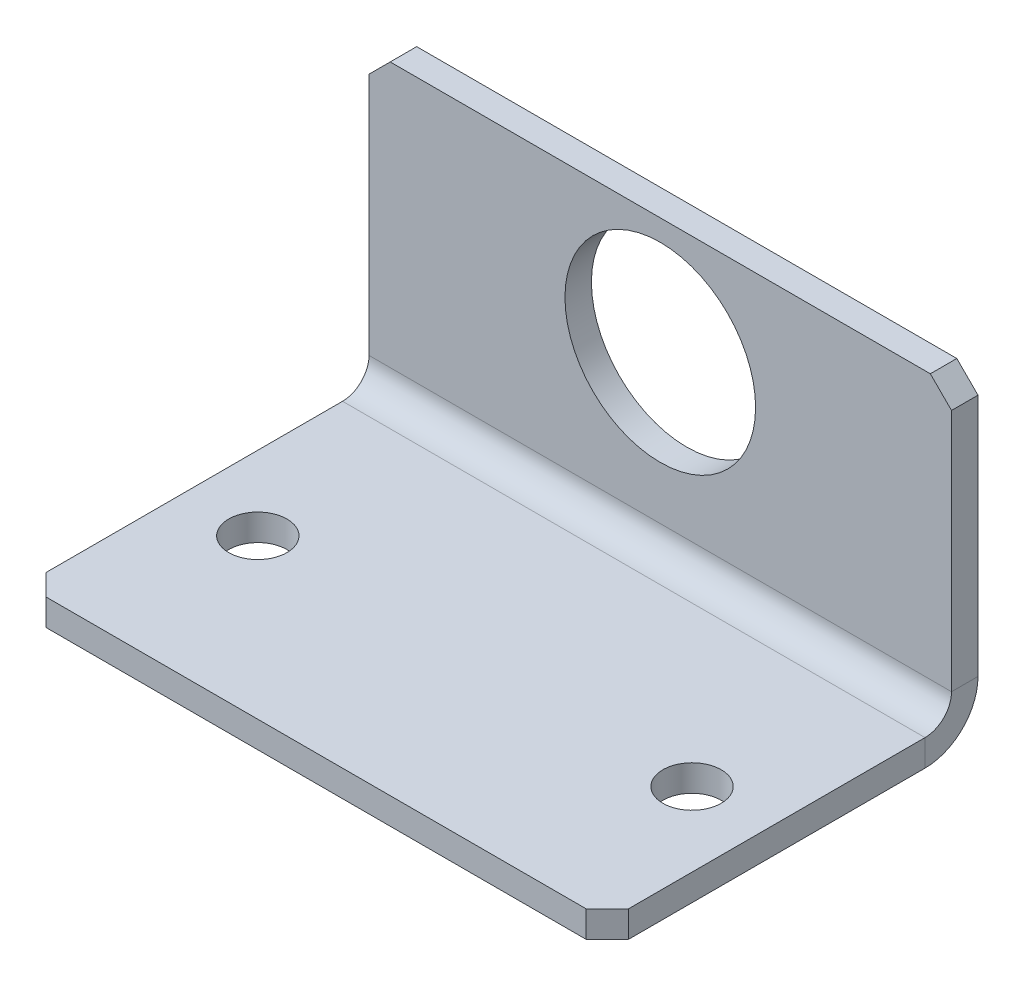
ISO-10303-21;
HEADER;
FILE_DESCRIPTION(('STEP AP214'),'2;1');
FILE_NAME('part.step','',(''),(''),'','','');
FILE_SCHEMA(('AUTOMOTIVE_DESIGN { 1 0 10303 214 1 1 1 1 }'));
ENDSEC;
DATA;
#1=APPLICATION_CONTEXT('core data for automotive mechanical design processes');
#2=APPLICATION_PROTOCOL_DEFINITION('international standard','automotive_design',2000,#1);
#3=PRODUCT_CONTEXT('',#1,'mechanical');
#4=PRODUCT('Part','Part','',(#3));
#5=PRODUCT_RELATED_PRODUCT_CATEGORY('part','',(#4));
#6=PRODUCT_DEFINITION_FORMATION('','',#4);
#7=PRODUCT_DEFINITION_CONTEXT('part definition',#1,'design');
#8=PRODUCT_DEFINITION('design','',#6,#7);
#9=PRODUCT_DEFINITION_SHAPE('','',#8);
#10=(LENGTH_UNIT() NAMED_UNIT(*) SI_UNIT(.MILLI.,.METRE.));
#11=(NAMED_UNIT(*) PLANE_ANGLE_UNIT() SI_UNIT($,.RADIAN.));
#12=(NAMED_UNIT(*) SI_UNIT($,.STERADIAN.) SOLID_ANGLE_UNIT());
#13=UNCERTAINTY_MEASURE_WITH_UNIT(LENGTH_MEASURE(1.E-05),#10,'distance_accuracy_value','');
#14=(GEOMETRIC_REPRESENTATION_CONTEXT(3) GLOBAL_UNCERTAINTY_ASSIGNED_CONTEXT((#13)) GLOBAL_UNIT_ASSIGNED_CONTEXT((#10,
#11,#12)) REPRESENTATION_CONTEXT('',''));
#15=CARTESIAN_POINT('',(0.,0.,0.));
#16=DIRECTION('',(0.,0.,1.));
#17=DIRECTION('',(1.,0.,0.));
#18=AXIS2_PLACEMENT_3D('',#15,#16,#17);
#19=CARTESIAN_POINT('',(27.4999999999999,0.,5.00000000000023));
#20=DIRECTION('',(1.,0.,0.));
#21=DIRECTION('',(0.,0.,-1.));
#22=AXIS2_PLACEMENT_3D('',#19,#20,#21);
#23=PLANE('',#22);
#24=DIRECTION('',(0.,1.,0.));
#25=VECTOR('',#24,1.);
#26=CARTESIAN_POINT('',(27.4999999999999,0.,5.00000000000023));
#27=LINE('',#26,#25);
#28=CARTESIAN_POINT('',(27.4999999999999,0.,5.00000000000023));
#29=VERTEX_POINT('',#28);
#30=CARTESIAN_POINT('',(27.5000000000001,2.5,5.00000000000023));
#31=VERTEX_POINT('',#30);
#32=EDGE_CURVE('E143',#29,#31,#27,.T.);
#33=ORIENTED_EDGE('',*,*,#32,.F.);
#34=CARTESIAN_POINT('',(27.5000000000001,5.,5.00000000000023));
#35=DIRECTION('',(-1.,0.,0.));
#36=DIRECTION('',(0.,0.,1.));
#37=AXIS2_PLACEMENT_3D('',#34,#35,#36);
#38=CIRCLE('',#37,5.);
#39=CARTESIAN_POINT('',(27.4999999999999,5.,2.35922392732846E-13));
#40=VERTEX_POINT('',#39);
#41=EDGE_CURVE('E140',#29,#40,#38,.F.);
#42=ORIENTED_EDGE('',*,*,#41,.T.);
#43=DIRECTION('',(0.,0.,-1.));
#44=VECTOR('',#43,1.);
#45=CARTESIAN_POINT('',(27.5000000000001,5.,2.50000000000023));
#46=LINE('',#45,#44);
#47=CARTESIAN_POINT('',(27.5000000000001,5.,2.50000000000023));
#48=VERTEX_POINT('',#47);
#49=EDGE_CURVE('E134',#48,#40,#46,.T.);
#50=ORIENTED_EDGE('',*,*,#49,.F.);
#51=CARTESIAN_POINT('',(27.5000000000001,5.,5.00000000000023));
#52=DIRECTION('',(1.,0.,0.));
#53=DIRECTION('',(0.,0.,-1.));
#54=AXIS2_PLACEMENT_3D('',#51,#52,#53);
#55=CIRCLE('',#54,2.5);
#56=EDGE_CURVE('E138',#31,#48,#55,.T.);
#57=ORIENTED_EDGE('',*,*,#56,.F.);
#58=EDGE_LOOP('',(#33,#42,#50,#57));
#59=FACE_BOUND('',#58,.T.);
#60=ADVANCED_FACE('F40',(#59),#23,.T.);
#61=CARTESIAN_POINT('',(27.5000000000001,5.,2.50000000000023));
#62=DIRECTION('',(1.,0.,0.));
#63=DIRECTION('',(0.,0.,-1.));
#64=AXIS2_PLACEMENT_3D('',#61,#62,#63);
#65=PLANE('',#64);
#66=DIRECTION('',(0.,0.,-1.));
#67=VECTOR('',#66,1.);
#68=CARTESIAN_POINT('',(27.5000000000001,2.5,35.));
#69=LINE('',#68,#67);
#70=CARTESIAN_POINT('',(27.5000000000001,2.5,33.));
#71=VERTEX_POINT('',#70);
#72=EDGE_CURVE('E167',#71,#31,#69,.T.);
#73=ORIENTED_EDGE('',*,*,#72,.F.);
#74=DIRECTION('',(0.,-1.,0.));
#75=VECTOR('',#74,1.);
#76=CARTESIAN_POINT('',(27.5000000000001,5.,33.));
#77=LINE('',#76,#75);
#78=CARTESIAN_POINT('',(27.5000000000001,0.,33.));
#79=VERTEX_POINT('',#78);
#80=EDGE_CURVE('E254',#71,#79,#77,.T.);
#81=ORIENTED_EDGE('',*,*,#80,.T.);
#82=DIRECTION('',(0.,0.,-1.));
#83=VECTOR('',#82,1.);
#84=CARTESIAN_POINT('',(27.5000000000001,0.,35.));
#85=LINE('',#84,#83);
#86=EDGE_CURVE('E172',#79,#29,#85,.T.);
#87=ORIENTED_EDGE('',*,*,#86,.T.);
#88=ORIENTED_EDGE('',*,*,#32,.T.);
#89=EDGE_LOOP('',(#73,#81,#87,#88));
#90=FACE_BOUND('',#89,.T.);
#91=ADVANCED_FACE('F324',(#90),#65,.T.);
#92=CARTESIAN_POINT('',(-27.4999999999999,5.,0.));
#93=DIRECTION('',(-1.,0.,0.));
#94=DIRECTION('',(0.,0.,1.));
#95=AXIS2_PLACEMENT_3D('',#92,#93,#94);
#96=PLANE('',#95);
#97=DIRECTION('',(0.,0.,1.));
#98=VECTOR('',#97,1.);
#99=CARTESIAN_POINT('',(-27.4999999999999,5.,0.));
#100=LINE('',#99,#98);
#101=CARTESIAN_POINT('',(-27.4999999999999,5.,0.));
#102=VERTEX_POINT('',#101);
#103=CARTESIAN_POINT('',(-27.4999999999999,5.,2.5));
#104=VERTEX_POINT('',#103);
#105=EDGE_CURVE('E144',#102,#104,#100,.T.);
#106=ORIENTED_EDGE('',*,*,#105,.F.);
#107=CARTESIAN_POINT('',(-27.4999999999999,5.,5.));
#108=DIRECTION('',(-1.,0.,0.));
#109=DIRECTION('',(0.,0.,1.));
#110=AXIS2_PLACEMENT_3D('',#107,#108,#109);
#111=CIRCLE('',#110,5.);
#112=CARTESIAN_POINT('',(-27.4999999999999,0.,5.));
#113=VERTEX_POINT('',#112);
#114=EDGE_CURVE('E197',#113,#102,#111,.F.);
#115=ORIENTED_EDGE('',*,*,#114,.F.);
#116=DIRECTION('',(0.,-1.,0.));
#117=VECTOR('',#116,1.);
#118=CARTESIAN_POINT('',(-27.4999999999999,2.5,5.));
#119=LINE('',#118,#117);
#120=CARTESIAN_POINT('',(-27.4999999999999,2.5,5.));
#121=VERTEX_POINT('',#120);
#122=EDGE_CURVE('E223',#121,#113,#119,.T.);
#123=ORIENTED_EDGE('',*,*,#122,.F.);
#124=CARTESIAN_POINT('',(-27.4999999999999,5.,5.));
#125=DIRECTION('',(1.,0.,0.));
#126=DIRECTION('',(0.,0.,-1.));
#127=AXIS2_PLACEMENT_3D('',#124,#125,#126);
#128=CIRCLE('',#127,2.5);
#129=EDGE_CURVE('E188',#121,#104,#128,.T.);
#130=ORIENTED_EDGE('',*,*,#129,.T.);
#131=EDGE_LOOP('',(#106,#115,#123,#130));
#132=FACE_BOUND('',#131,.T.);
#133=ADVANCED_FACE('F329',(#132),#96,.T.);
#134=CARTESIAN_POINT('',(-27.4999999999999,2.5,5.));
#135=DIRECTION('',(-1.,0.,0.));
#136=DIRECTION('',(0.,0.,1.));
#137=AXIS2_PLACEMENT_3D('',#134,#135,#136);
#138=PLANE('',#137);
#139=DIRECTION('',(0.,1.,0.));
#140=VECTOR('',#139,1.);
#141=CARTESIAN_POINT('',(-27.4999999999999,0.,2.5));
#142=LINE('',#141,#140);
#143=CARTESIAN_POINT('',(-27.4999999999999,28.,2.5));
#144=VERTEX_POINT('',#143);
#145=EDGE_CURVE('E151',#104,#144,#142,.T.);
#146=ORIENTED_EDGE('',*,*,#145,.T.);
#147=DIRECTION('',(0.,0.,-1.));
#148=VECTOR('',#147,1.);
#149=CARTESIAN_POINT('',(-27.4999999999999,28.,5.));
#150=LINE('',#149,#148);
#151=CARTESIAN_POINT('',(-27.4999999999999,28.,0.));
#152=VERTEX_POINT('',#151);
#153=EDGE_CURVE('E11',#144,#152,#150,.T.);
#154=ORIENTED_EDGE('',*,*,#153,.T.);
#155=DIRECTION('',(0.,1.,0.));
#156=VECTOR('',#155,1.);
#157=CARTESIAN_POINT('',(-27.4999999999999,0.,0.));
#158=LINE('',#157,#156);
#159=EDGE_CURVE('E181',#102,#152,#158,.T.);
#160=ORIENTED_EDGE('',*,*,#159,.F.);
#161=ORIENTED_EDGE('',*,*,#105,.T.);
#162=EDGE_LOOP('',(#146,#154,#160,#161));
#163=FACE_BOUND('',#162,.T.);
#164=ADVANCED_FACE('F351',(#163),#138,.T.);
#165=CARTESIAN_POINT('',(27.4999999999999,0.,2.35922392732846E-13));
#166=DIRECTION('',(0.,0.,1.));
#167=DIRECTION('',(1.,0.,0.));
#168=AXIS2_PLACEMENT_3D('',#165,#166,#167);
#169=PLANE('',#168);
#170=CARTESIAN_POINT('',(0.,19.,0.));
#171=DIRECTION('',(0.,0.,1.));
#172=DIRECTION('',(1.,0.,0.));
#173=AXIS2_PLACEMENT_3D('',#170,#171,#172);
#174=CIRCLE('',#173,9.);
#175=CARTESIAN_POINT('',(9.,19.,0.));
#176=VERTEX_POINT('',#175);
#177=EDGE_CURVE('E303',#176,#176,#174,.F.);
#178=ORIENTED_EDGE('',*,*,#177,.F.);
#179=EDGE_LOOP('',(#178));
#180=FACE_BOUND('',#179,.T.);
#181=DIRECTION('',(-1.,0.,0.));
#182=VECTOR('',#181,1.);
#183=CARTESIAN_POINT('',(27.5000000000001,30.,2.35922392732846E-13));
#184=LINE('',#183,#182);
#185=CARTESIAN_POINT('',(25.5000000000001,30.,2.35922392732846E-13));
#186=VERTEX_POINT('',#185);
#187=CARTESIAN_POINT('',(-25.4999999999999,30.,0.));
#188=VERTEX_POINT('',#187);
#189=EDGE_CURVE('E220',#186,#188,#184,.T.);
#190=ORIENTED_EDGE('',*,*,#189,.F.);
#191=DIRECTION('',(-0.707106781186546,0.707106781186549,0.));
#192=VECTOR('',#191,1.);
#193=CARTESIAN_POINT('',(25.5000000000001,30.,2.35922392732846E-13));
#194=LINE('',#193,#192);
#195=CARTESIAN_POINT('',(27.5000000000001,28.,2.35922392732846E-13));
#196=VERTEX_POINT('',#195);
#197=EDGE_CURVE('E267',#186,#196,#194,.F.);
#198=ORIENTED_EDGE('',*,*,#197,.T.);
#199=DIRECTION('',(0.,1.,0.));
#200=VECTOR('',#199,1.);
#201=CARTESIAN_POINT('',(27.4999999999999,0.,2.35922392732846E-13));
#202=LINE('',#201,#200);
#203=EDGE_CURVE('E161',#40,#196,#202,.T.);
#204=ORIENTED_EDGE('',*,*,#203,.F.);
#205=DIRECTION('',(-1.,0.,0.));
#206=VECTOR('',#205,1.);
#207=CARTESIAN_POINT('',(27.4999999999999,5.,2.35922392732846E-13));
#208=LINE('',#207,#206);
#209=EDGE_CURVE('E180',#40,#102,#208,.T.);
#210=ORIENTED_EDGE('',*,*,#209,.T.);
#211=ORIENTED_EDGE('',*,*,#159,.T.);
#212=DIRECTION('',(-0.707106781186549,-0.707106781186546,0.));
#213=VECTOR('',#212,1.);
#214=CARTESIAN_POINT('',(-27.4999999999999,28.,0.));
#215=LINE('',#214,#213);
#216=EDGE_CURVE('E264',#152,#188,#215,.F.);
#217=ORIENTED_EDGE('',*,*,#216,.T.);
#218=EDGE_LOOP('',(#190,#198,#204,#210,#211,#217));
#219=FACE_BOUND('',#218,.T.);
#220=ADVANCED_FACE('F285',(#180,#219),#169,.F.);
#221=CARTESIAN_POINT('',(27.5000000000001,30.,2.50000000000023));
#222=DIRECTION('',(0.,1.,0.));
#223=DIRECTION('',(0.,0.,1.));
#224=AXIS2_PLACEMENT_3D('',#221,#222,#223);
#225=PLANE('',#224);
#226=DIRECTION('',(-1.,0.,0.));
#227=VECTOR('',#226,1.);
#228=CARTESIAN_POINT('',(27.5000000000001,30.,2.50000000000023));
#229=LINE('',#228,#227);
#230=CARTESIAN_POINT('',(25.5000000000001,30.,2.50000000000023));
#231=VERTEX_POINT('',#230);
#232=CARTESIAN_POINT('',(-25.4999999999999,30.,2.5));
#233=VERTEX_POINT('',#232);
#234=EDGE_CURVE('E156',#231,#233,#229,.T.);
#235=ORIENTED_EDGE('',*,*,#234,.F.);
#236=DIRECTION('',(0.,0.,-1.));
#237=VECTOR('',#236,1.);
#238=CARTESIAN_POINT('',(25.5000000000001,30.,2.50000000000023));
#239=LINE('',#238,#237);
#240=EDGE_CURVE('E260',#231,#186,#239,.T.);
#241=ORIENTED_EDGE('',*,*,#240,.T.);
#242=ORIENTED_EDGE('',*,*,#189,.T.);
#243=DIRECTION('',(0.,0.,1.));
#244=VECTOR('',#243,1.);
#245=CARTESIAN_POINT('',(-25.4999999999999,30.,2.5));
#246=LINE('',#245,#244);
#247=EDGE_CURVE('E257',#188,#233,#246,.T.);
#248=ORIENTED_EDGE('',*,*,#247,.T.);
#249=EDGE_LOOP('',(#235,#241,#242,#248));
#250=FACE_BOUND('',#249,.T.);
#251=ADVANCED_FACE('F279',(#250),#225,.T.);
#252=CARTESIAN_POINT('',(27.4999999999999,0.,2.50000000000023));
#253=DIRECTION('',(0.,0.,1.));
#254=DIRECTION('',(1.,0.,0.));
#255=AXIS2_PLACEMENT_3D('',#252,#253,#254);
#256=PLANE('',#255);
#257=CARTESIAN_POINT('',(0.,19.,2.5));
#258=DIRECTION('',(0.,0.,1.));
#259=DIRECTION('',(1.,0.,0.));
#260=AXIS2_PLACEMENT_3D('',#257,#258,#259);
#261=CIRCLE('',#260,9.);
#262=CARTESIAN_POINT('',(9.,19.,2.5));
#263=VERTEX_POINT('',#262);
#264=EDGE_CURVE('E306',#263,#263,#261,.T.);
#265=ORIENTED_EDGE('',*,*,#264,.F.);
#266=EDGE_LOOP('',(#265));
#267=FACE_BOUND('',#266,.T.);
#268=DIRECTION('',(0.,1.,0.));
#269=VECTOR('',#268,1.);
#270=CARTESIAN_POINT('',(27.4999999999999,0.,2.50000000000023));
#271=LINE('',#270,#269);
#272=CARTESIAN_POINT('',(27.5000000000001,28.,2.50000000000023));
#273=VERTEX_POINT('',#272);
#274=EDGE_CURVE('E149',#48,#273,#271,.T.);
#275=ORIENTED_EDGE('',*,*,#274,.T.);
#276=DIRECTION('',(0.707106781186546,-0.707106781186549,0.));
#277=VECTOR('',#276,1.);
#278=CARTESIAN_POINT('',(41.5000000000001,14.,2.50000000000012));
#279=LINE('',#278,#277);
#280=EDGE_CURVE('E49',#273,#231,#279,.F.);
#281=ORIENTED_EDGE('',*,*,#280,.T.);
#282=ORIENTED_EDGE('',*,*,#234,.T.);
#283=DIRECTION('',(0.707106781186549,0.707106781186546,0.));
#284=VECTOR('',#283,1.);
#285=CARTESIAN_POINT('',(-13.9999999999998,41.5,2.50000000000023));
#286=LINE('',#285,#284);
#287=EDGE_CURVE('E56',#233,#144,#286,.F.);
#288=ORIENTED_EDGE('',*,*,#287,.T.);
#289=ORIENTED_EDGE('',*,*,#145,.F.);
#290=DIRECTION('',(-1.,0.,0.));
#291=VECTOR('',#290,1.);
#292=CARTESIAN_POINT('',(27.5000000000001,5.,2.50000000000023));
#293=LINE('',#292,#291);
#294=EDGE_CURVE('E147',#48,#104,#293,.T.);
#295=ORIENTED_EDGE('',*,*,#294,.F.);
#296=EDGE_LOOP('',(#275,#281,#282,#288,#289,#295));
#297=FACE_BOUND('',#296,.T.);
#298=ADVANCED_FACE('F148',(#267,#297),#256,.T.);
#299=CARTESIAN_POINT('',(27.5000000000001,5.,5.00000000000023));
#300=DIRECTION('',(-1.,0.,0.));
#301=DIRECTION('',(0.,0.,1.));
#302=AXIS2_PLACEMENT_3D('',#299,#300,#301);
#303=CYLINDRICAL_SURFACE('',#302,2.5);
#304=ORIENTED_EDGE('',*,*,#129,.F.);
#305=DIRECTION('',(-1.,0.,0.));
#306=VECTOR('',#305,1.);
#307=CARTESIAN_POINT('',(27.5000000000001,2.5,5.00000000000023));
#308=LINE('',#307,#306);
#309=EDGE_CURVE('E157',#31,#121,#308,.T.);
#310=ORIENTED_EDGE('',*,*,#309,.F.);
#311=ORIENTED_EDGE('',*,*,#56,.T.);
#312=ORIENTED_EDGE('',*,*,#294,.T.);
#313=EDGE_LOOP('',(#304,#310,#311,#312));
#314=FACE_BOUND('',#313,.T.);
#315=ADVANCED_FACE('F164',(#314),#303,.F.);
#316=CARTESIAN_POINT('',(27.5000000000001,2.5,35.));
#317=DIRECTION('',(0.,1.,0.));
#318=DIRECTION('',(0.,0.,1.));
#319=AXIS2_PLACEMENT_3D('',#316,#317,#318);
#320=PLANE('',#319);
#321=CARTESIAN_POINT('',(-20.5,2.5,20.));
#322=DIRECTION('',(0.,1.,0.));
#323=DIRECTION('',(0.,0.,1.));
#324=AXIS2_PLACEMENT_3D('',#321,#322,#323);
#325=CIRCLE('',#324,2.75);
#326=CARTESIAN_POINT('',(-20.5,2.5,22.75));
#327=VERTEX_POINT('',#326);
#328=EDGE_CURVE('E299',#327,#327,#325,.T.);
#329=ORIENTED_EDGE('',*,*,#328,.F.);
#330=EDGE_LOOP('',(#329));
#331=FACE_BOUND('',#330,.T.);
#332=CARTESIAN_POINT('',(20.5,2.5,20.));
#333=DIRECTION('',(0.,1.,0.));
#334=DIRECTION('',(0.,0.,1.));
#335=AXIS2_PLACEMENT_3D('',#332,#333,#334);
#336=CIRCLE('',#335,2.75);
#337=CARTESIAN_POINT('',(20.5,2.5,22.75));
#338=VERTEX_POINT('',#337);
#339=EDGE_CURVE('E292',#338,#338,#336,.T.);
#340=ORIENTED_EDGE('',*,*,#339,.F.);
#341=EDGE_LOOP('',(#340));
#342=FACE_BOUND('',#341,.T.);
#343=DIRECTION('',(0.,0.,-1.));
#344=VECTOR('',#343,1.);
#345=CARTESIAN_POINT('',(-27.4999999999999,2.5,35.));
#346=LINE('',#345,#344);
#347=CARTESIAN_POINT('',(-27.4999999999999,2.5,33.));
#348=VERTEX_POINT('',#347);
#349=EDGE_CURVE('E191',#348,#121,#346,.T.);
#350=ORIENTED_EDGE('',*,*,#349,.F.);
#351=DIRECTION('',(0.707106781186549,0.,0.707106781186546));
#352=VECTOR('',#351,1.);
#353=CARTESIAN_POINT('',(1.00000000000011,2.5,61.5));
#354=LINE('',#353,#352);
#355=CARTESIAN_POINT('',(-25.4999999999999,2.5,35.));
#356=VERTEX_POINT('',#355);
#357=EDGE_CURVE('E238',#348,#356,#354,.T.);
#358=ORIENTED_EDGE('',*,*,#357,.T.);
#359=DIRECTION('',(-1.,0.,0.));
#360=VECTOR('',#359,1.);
#361=CARTESIAN_POINT('',(27.5000000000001,2.5,35.));
#362=LINE('',#361,#360);
#363=CARTESIAN_POINT('',(25.5000000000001,2.5,35.));
#364=VERTEX_POINT('',#363);
#365=EDGE_CURVE('E212',#364,#356,#362,.T.);
#366=ORIENTED_EDGE('',*,*,#365,.F.);
#367=DIRECTION('',(-0.707106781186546,0.,0.707106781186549));
#368=VECTOR('',#367,1.);
#369=CARTESIAN_POINT('',(26.5,2.5,34.));
#370=LINE('',#369,#368);
#371=EDGE_CURVE('E235',#364,#71,#370,.F.);
#372=ORIENTED_EDGE('',*,*,#371,.T.);
#373=ORIENTED_EDGE('',*,*,#72,.T.);
#374=ORIENTED_EDGE('',*,*,#309,.T.);
#375=EDGE_LOOP('',(#350,#358,#366,#372,#373,#374));
#376=FACE_BOUND('',#375,.T.);
#377=ADVANCED_FACE('F320',(#331,#342,#376),#320,.T.);
#378=CARTESIAN_POINT('',(27.5000000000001,0.,35.));
#379=DIRECTION('',(0.,0.,1.));
#380=DIRECTION('',(1.,0.,0.));
#381=AXIS2_PLACEMENT_3D('',#378,#379,#380);
#382=PLANE('',#381);
#383=ORIENTED_EDGE('',*,*,#365,.T.);
#384=DIRECTION('',(0.,-1.,0.));
#385=VECTOR('',#384,1.);
#386=CARTESIAN_POINT('',(-25.4999999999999,0.,35.));
#387=LINE('',#386,#385);
#388=CARTESIAN_POINT('',(-25.4999999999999,0.,35.));
#389=VERTEX_POINT('',#388);
#390=EDGE_CURVE('E245',#356,#389,#387,.T.);
#391=ORIENTED_EDGE('',*,*,#390,.T.);
#392=DIRECTION('',(-1.,0.,0.));
#393=VECTOR('',#392,1.);
#394=CARTESIAN_POINT('',(27.5000000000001,0.,35.));
#395=LINE('',#394,#393);
#396=CARTESIAN_POINT('',(25.5000000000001,0.,35.));
#397=VERTEX_POINT('',#396);
#398=EDGE_CURVE('E208',#397,#389,#395,.T.);
#399=ORIENTED_EDGE('',*,*,#398,.F.);
#400=DIRECTION('',(0.,1.,0.));
#401=VECTOR('',#400,1.);
#402=CARTESIAN_POINT('',(25.5000000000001,0.,35.));
#403=LINE('',#402,#401);
#404=EDGE_CURVE('E241',#397,#364,#403,.T.);
#405=ORIENTED_EDGE('',*,*,#404,.T.);
#406=EDGE_LOOP('',(#383,#391,#399,#405));
#407=FACE_BOUND('',#406,.T.);
#408=ADVANCED_FACE('F374',(#407),#382,.T.);
#409=CARTESIAN_POINT('',(27.5000000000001,0.,35.));
#410=DIRECTION('',(0.,1.,0.));
#411=DIRECTION('',(0.,0.,1.));
#412=AXIS2_PLACEMENT_3D('',#409,#410,#411);
#413=PLANE('',#412);
#414=CARTESIAN_POINT('',(-20.5,0.,20.));
#415=DIRECTION('',(0.,1.,0.));
#416=DIRECTION('',(0.,0.,1.));
#417=AXIS2_PLACEMENT_3D('',#414,#415,#416);
#418=CIRCLE('',#417,2.75);
#419=CARTESIAN_POINT('',(-20.5,0.,22.75));
#420=VERTEX_POINT('',#419);
#421=EDGE_CURVE('E295',#420,#420,#418,.F.);
#422=ORIENTED_EDGE('',*,*,#421,.F.);
#423=EDGE_LOOP('',(#422));
#424=FACE_BOUND('',#423,.T.);
#425=CARTESIAN_POINT('',(20.5,0.,20.));
#426=DIRECTION('',(0.,1.,0.));
#427=DIRECTION('',(0.,0.,1.));
#428=AXIS2_PLACEMENT_3D('',#425,#426,#427);
#429=CIRCLE('',#428,2.75);
#430=CARTESIAN_POINT('',(20.5,0.,22.75));
#431=VERTEX_POINT('',#430);
#432=EDGE_CURVE('E185',#431,#431,#429,.F.);
#433=ORIENTED_EDGE('',*,*,#432,.F.);
#434=EDGE_LOOP('',(#433));
#435=FACE_BOUND('',#434,.T.);
#436=ORIENTED_EDGE('',*,*,#398,.T.);
#437=DIRECTION('',(-0.707106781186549,0.,-0.707106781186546));
#438=VECTOR('',#437,1.);
#439=CARTESIAN_POINT('',(-27.4999999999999,0.,33.));
#440=LINE('',#439,#438);
#441=CARTESIAN_POINT('',(-27.4999999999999,0.,33.));
#442=VERTEX_POINT('',#441);
#443=EDGE_CURVE('E251',#389,#442,#440,.T.);
#444=ORIENTED_EDGE('',*,*,#443,.T.);
#445=DIRECTION('',(0.,0.,-1.));
#446=VECTOR('',#445,1.);
#447=CARTESIAN_POINT('',(-27.4999999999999,0.,35.));
#448=LINE('',#447,#446);
#449=EDGE_CURVE('E194',#442,#113,#448,.T.);
#450=ORIENTED_EDGE('',*,*,#449,.T.);
#451=DIRECTION('',(-1.,0.,0.));
#452=VECTOR('',#451,1.);
#453=CARTESIAN_POINT('',(27.4999999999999,0.,5.00000000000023));
#454=LINE('',#453,#452);
#455=EDGE_CURVE('E204',#29,#113,#454,.T.);
#456=ORIENTED_EDGE('',*,*,#455,.F.);
#457=ORIENTED_EDGE('',*,*,#86,.F.);
#458=DIRECTION('',(0.707106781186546,0.,-0.707106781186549));
#459=VECTOR('',#458,1.);
#460=CARTESIAN_POINT('',(25.5000000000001,0.,35.));
#461=LINE('',#460,#459);
#462=EDGE_CURVE('E248',#79,#397,#461,.F.);
#463=ORIENTED_EDGE('',*,*,#462,.T.);
#464=EDGE_LOOP('',(#436,#444,#450,#456,#457,#463));
#465=FACE_BOUND('',#464,.T.);
#466=ADVANCED_FACE('F367',(#424,#435,#465),#413,.F.);
#467=CARTESIAN_POINT('',(27.5000000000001,5.,5.00000000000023));
#468=DIRECTION('',(-1.,0.,0.));
#469=DIRECTION('',(0.,0.,1.));
#470=AXIS2_PLACEMENT_3D('',#467,#468,#469);
#471=CYLINDRICAL_SURFACE('',#470,5.);
#472=ORIENTED_EDGE('',*,*,#114,.T.);
#473=ORIENTED_EDGE('',*,*,#209,.F.);
#474=ORIENTED_EDGE('',*,*,#41,.F.);
#475=ORIENTED_EDGE('',*,*,#455,.T.);
#476=EDGE_LOOP('',(#472,#473,#474,#475));
#477=FACE_BOUND('',#476,.T.);
#478=ADVANCED_FACE('F353',(#477),#471,.T.);
#479=CARTESIAN_POINT('',(27.5000000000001,5.,5.00000000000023));
#480=DIRECTION('',(1.,0.,0.));
#481=DIRECTION('',(0.,0.,-1.));
#482=AXIS2_PLACEMENT_3D('',#479,#480,#481);
#483=PLANE('',#482);
#484=ORIENTED_EDGE('',*,*,#203,.T.);
#485=DIRECTION('',(0.,0.,1.));
#486=VECTOR('',#485,1.);
#487=CARTESIAN_POINT('',(27.5000000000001,28.,5.00000000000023));
#488=LINE('',#487,#486);
#489=EDGE_CURVE('E64',#196,#273,#488,.T.);
#490=ORIENTED_EDGE('',*,*,#489,.T.);
#491=ORIENTED_EDGE('',*,*,#274,.F.);
#492=ORIENTED_EDGE('',*,*,#49,.T.);
#493=EDGE_LOOP('',(#484,#490,#491,#492));
#494=FACE_BOUND('',#493,.T.);
#495=ADVANCED_FACE('F159',(#494),#483,.T.);
#496=CARTESIAN_POINT('',(-27.4999999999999,5.,5.));
#497=DIRECTION('',(1.,0.,0.));
#498=DIRECTION('',(0.,0.,-1.));
#499=AXIS2_PLACEMENT_3D('',#496,#497,#498);
#500=PLANE('',#499);
#501=ORIENTED_EDGE('',*,*,#449,.F.);
#502=DIRECTION('',(0.,1.,0.));
#503=VECTOR('',#502,1.);
#504=CARTESIAN_POINT('',(-27.4999999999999,2.5,33.));
#505=LINE('',#504,#503);
#506=EDGE_CURVE('E231',#442,#348,#505,.T.);
#507=ORIENTED_EDGE('',*,*,#506,.T.);
#508=ORIENTED_EDGE('',*,*,#349,.T.);
#509=ORIENTED_EDGE('',*,*,#122,.T.);
#510=EDGE_LOOP('',(#501,#507,#508,#509));
#511=FACE_BOUND('',#510,.T.);
#512=ADVANCED_FACE('F371',(#511),#500,.F.);
#513=CARTESIAN_POINT('',(20.5,-0.00100000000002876,20.));
#514=DIRECTION('',(0.,1.,0.));
#515=DIRECTION('',(0.,0.,1.));
#516=AXIS2_PLACEMENT_3D('',#513,#514,#515);
#517=CYLINDRICAL_SURFACE('',#516,2.75);
#518=ORIENTED_EDGE('',*,*,#339,.T.);
#519=EDGE_LOOP('',(#518));
#520=FACE_BOUND('',#519,.T.);
#521=ORIENTED_EDGE('',*,*,#432,.T.);
#522=EDGE_LOOP('',(#521));
#523=FACE_BOUND('',#522,.T.);
#524=ADVANCED_FACE('F392',(#520,#523),#517,.F.);
#525=CARTESIAN_POINT('',(-20.5,-0.000999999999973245,20.));
#526=DIRECTION('',(0.,1.,0.));
#527=DIRECTION('',(0.,0.,1.));
#528=AXIS2_PLACEMENT_3D('',#525,#526,#527);
#529=CYLINDRICAL_SURFACE('',#528,2.75);
#530=ORIENTED_EDGE('',*,*,#328,.T.);
#531=EDGE_LOOP('',(#530));
#532=FACE_BOUND('',#531,.T.);
#533=ORIENTED_EDGE('',*,*,#421,.T.);
#534=EDGE_LOOP('',(#533));
#535=FACE_BOUND('',#534,.T.);
#536=ADVANCED_FACE('F397',(#532,#535),#529,.F.);
#537=CARTESIAN_POINT('',(0.,19.,-0.001000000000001));
#538=DIRECTION('',(0.,0.,1.));
#539=DIRECTION('',(1.,0.,0.));
#540=AXIS2_PLACEMENT_3D('',#537,#538,#539);
#541=CYLINDRICAL_SURFACE('',#540,9.);
#542=ORIENTED_EDGE('',*,*,#264,.T.);
#543=EDGE_LOOP('',(#542));
#544=FACE_BOUND('',#543,.T.);
#545=ORIENTED_EDGE('',*,*,#177,.T.);
#546=EDGE_LOOP('',(#545));
#547=FACE_BOUND('',#546,.T.);
#548=ADVANCED_FACE('F311',(#544,#547),#541,.F.);
#549=CARTESIAN_POINT('',(-27.4999999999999,5.,33.));
#550=DIRECTION('',(-0.707106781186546,0.,0.707106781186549));
#551=DIRECTION('',(0.707106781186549,0.,0.707106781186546));
#552=AXIS2_PLACEMENT_3D('',#549,#550,#551);
#553=PLANE('',#552);
#554=ORIENTED_EDGE('',*,*,#443,.F.);
#555=ORIENTED_EDGE('',*,*,#390,.F.);
#556=ORIENTED_EDGE('',*,*,#357,.F.);
#557=ORIENTED_EDGE('',*,*,#506,.F.);
#558=EDGE_LOOP('',(#554,#555,#556,#557));
#559=FACE_BOUND('',#558,.T.);
#560=ADVANCED_FACE('F334',(#559),#553,.T.);
#561=CARTESIAN_POINT('',(25.5000000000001,0.,35.));
#562=DIRECTION('',(-0.707106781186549,0.,-0.707106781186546));
#563=DIRECTION('',(-0.707106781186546,0.,0.707106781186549));
#564=AXIS2_PLACEMENT_3D('',#561,#562,#563);
#565=PLANE('',#564);
#566=ORIENTED_EDGE('',*,*,#462,.F.);
#567=ORIENTED_EDGE('',*,*,#80,.F.);
#568=ORIENTED_EDGE('',*,*,#371,.F.);
#569=ORIENTED_EDGE('',*,*,#404,.F.);
#570=EDGE_LOOP('',(#566,#567,#568,#569));
#571=FACE_BOUND('',#570,.T.);
#572=ADVANCED_FACE('F337',(#571),#565,.F.);
#573=CARTESIAN_POINT('',(25.5000000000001,30.,2.50000000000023));
#574=DIRECTION('',(-0.707106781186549,-0.707106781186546,0.));
#575=DIRECTION('',(0.707106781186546,-0.707106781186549,0.));
#576=AXIS2_PLACEMENT_3D('',#573,#574,#575);
#577=PLANE('',#576);
#578=ORIENTED_EDGE('',*,*,#280,.F.);
#579=ORIENTED_EDGE('',*,*,#489,.F.);
#580=ORIENTED_EDGE('',*,*,#197,.F.);
#581=ORIENTED_EDGE('',*,*,#240,.F.);
#582=EDGE_LOOP('',(#578,#579,#580,#581));
#583=FACE_BOUND('',#582,.T.);
#584=ADVANCED_FACE('F282',(#583),#577,.F.);
#585=CARTESIAN_POINT('',(-27.4999999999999,28.,5.));
#586=DIRECTION('',(0.707106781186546,-0.707106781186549,0.));
#587=DIRECTION('',(0.707106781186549,0.707106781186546,0.));
#588=AXIS2_PLACEMENT_3D('',#585,#586,#587);
#589=PLANE('',#588);
#590=ORIENTED_EDGE('',*,*,#287,.F.);
#591=ORIENTED_EDGE('',*,*,#247,.F.);
#592=ORIENTED_EDGE('',*,*,#216,.F.);
#593=ORIENTED_EDGE('',*,*,#153,.F.);
#594=EDGE_LOOP('',(#590,#591,#592,#593));
#595=FACE_BOUND('',#594,.T.);
#596=ADVANCED_FACE('F42',(#595),#589,.F.);
#597=CLOSED_SHELL('',(#60,#91,#133,#164,#220,#251,#298,#315,#377,#408,#466,#478,#495,#512,#524,
#536,#548,#560,#572,#584,#596));
#598=MANIFOLD_SOLID_BREP('B2',#597);
#599=ADVANCED_BREP_SHAPE_REPRESENTATION('',(#18,#598),#14);
#600=SHAPE_DEFINITION_REPRESENTATION(#9,#599);
ENDSEC;
END-ISO-10303-21;
